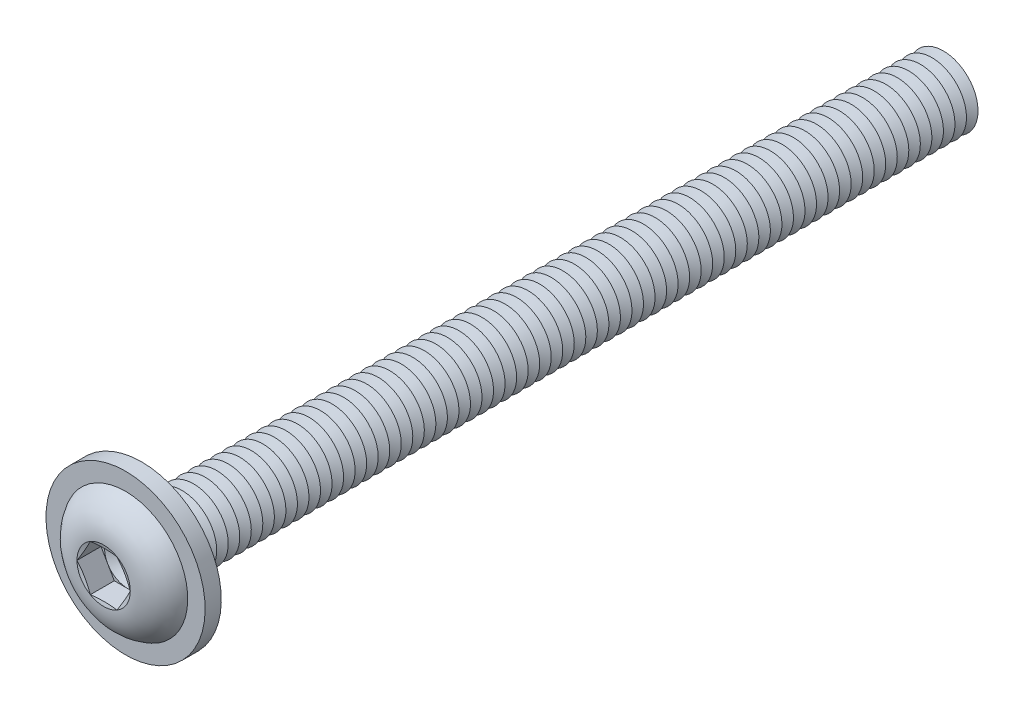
from build123d import *

# Parameters (mm, degrees)
FILLET1_R           = 0.25
LPATTERN1_COUNT     = 70
LPATTERN1_PITCH     = 0.5
CUT_EXTRUDE1_DEPTH  = 1.04
SKETCH5_R           = 3.45
SKETCH5_R_2         = 1.75
BOSS_EXTRUDE1_DEPTH = 0.7


with BuildPart() as part:
    # Sketch1 → Revolve1 (revolve)
    with BuildSketch(Plane(origin=(0, 0, 0), x_dir=(0, 0, -1), z_dir=(1, 0, 0))):
        with BuildLine():
            Line((0, 1.5), (0, 2.85))
            ThreePointArc((0, 2.85), (-1.182850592, 2.35063849), (-1.65, 1.1547))
            Line((-1.65, 1.1547), (-1.495299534, 0.57735))
            Line((-1.495299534, 0.57735), (-1.65, 0.57735))
            Line((-1.65, 0.57735), (-1.65, 0))
            Line((-1.65, 0), (35, 0))
            Line((35, 0), (35, 1.5))
            Line((35, 1.5), (0, 1.5))
        make_face()
    revolve(axis=Axis((0, 0, -35), (0, 0, 1)))

    # Fillet1
    fillet1_edges = [part.edges().sort_by_distance(p)[0] for p in [
        (0, -1.5, 0),
    ]]
    fillet(fillet1_edges, radius=FILLET1_R)

    # Sketch2 → Cut-Revolve1 (revolve, cut)
    with BuildSketch(Plane(origin=(0, 0, 0), x_dir=(0, 0, -1), z_dir=(1, 0, 0))):
        Polygon((34.75, 1.5), (35.25, 1.5), (35, 1.066987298), align=None)
    cut_revolve1 = revolve(axis=Axis((0, 0, -35), (0, 0, -1)), mode=Mode.SUBTRACT)

    # LPattern1: Cut-Revolve1 ×70
    with Locations(*[(0, 0, i * LPATTERN1_PITCH) for i in range(1, LPATTERN1_COUNT)]):
        add(cut_revolve1, mode=Mode.SUBTRACT)

    # Sketch3 → Cut-Extrude1 (cut)
    with BuildSketch(Plane.XY.offset(1.65)):
        Polygon((0.57735, 0.999999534), (-0.57735, 0.999999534), (-1.1547, 0), (-0.57735, -0.999999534), (0.57735, -0.999999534), (1.1547, 0), align=None)
    extrude(amount=-CUT_EXTRUDE1_DEPTH, mode=Mode.SUBTRACT)

    # Cut-Extrude2 cone 1 section (on through the dimple's axis) → Cut-Extrude2 (revolve, cut)
    with BuildSketch(Plane(origin=(0, 0, 0.61), x_dir=(0, -1, 0), z_dir=(1, 0, 0))):
        Polygon((0, 0), (0.999999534, 0), (0, 0.57735), align=None)
    revolve(axis=Axis((0, 0, 0.61), (0, 0, -1)), mode=Mode.SUBTRACT)

    # Sketch5 → Boss-Extrude1 (add)
    with BuildSketch(Plane(origin=(0, 0, 0), x_dir=(-1, 0, 0), z_dir=(0, 0, -1))):
        with Locations(Location((0, 0, 0), (0, 0, 90))):
            Circle(SKETCH5_R)
        Circle(SKETCH5_R_2, mode=Mode.SUBTRACT)
    extrude(amount=-BOSS_EXTRUDE1_DEPTH)


solid = part.part
